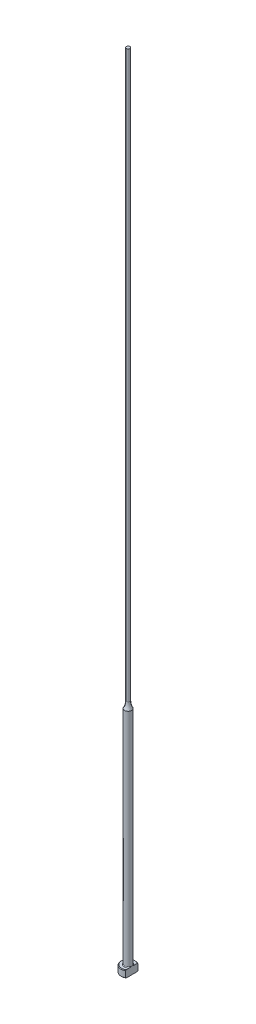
ISO-10303-21;
HEADER;
FILE_DESCRIPTION(('STEP AP214'),'2;1');
FILE_NAME('part.step','',(''),(''),'','','');
FILE_SCHEMA(('AUTOMOTIVE_DESIGN { 1 0 10303 214 1 1 1 1 }'));
ENDSEC;
DATA;
#1=APPLICATION_CONTEXT('core data for automotive mechanical design processes');
#2=APPLICATION_PROTOCOL_DEFINITION('international standard','automotive_design',2000,#1);
#3=PRODUCT_CONTEXT('',#1,'mechanical');
#4=PRODUCT('Part','Part','',(#3));
#5=PRODUCT_RELATED_PRODUCT_CATEGORY('part','',(#4));
#6=PRODUCT_DEFINITION_FORMATION('','',#4);
#7=PRODUCT_DEFINITION_CONTEXT('part definition',#1,'design');
#8=PRODUCT_DEFINITION('design','',#6,#7);
#9=PRODUCT_DEFINITION_SHAPE('','',#8);
#10=(LENGTH_UNIT() NAMED_UNIT(*) SI_UNIT(.MILLI.,.METRE.));
#11=(NAMED_UNIT(*) PLANE_ANGLE_UNIT() SI_UNIT($,.RADIAN.));
#12=(NAMED_UNIT(*) SI_UNIT($,.STERADIAN.) SOLID_ANGLE_UNIT());
#13=UNCERTAINTY_MEASURE_WITH_UNIT(LENGTH_MEASURE(1.E-05),#10,'distance_accuracy_value','');
#14=(GEOMETRIC_REPRESENTATION_CONTEXT(3) GLOBAL_UNCERTAINTY_ASSIGNED_CONTEXT((#13)) GLOBAL_UNIT_ASSIGNED_CONTEXT((#10,
#11,#12)) REPRESENTATION_CONTEXT('',''));
#15=CARTESIAN_POINT('',(0.,0.,0.));
#16=DIRECTION('',(0.,0.,1.));
#17=DIRECTION('',(1.,0.,0.));
#18=AXIS2_PLACEMENT_3D('',#15,#16,#17);
#19=CARTESIAN_POINT('',(-3.17499999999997,3.175,0.));
#20=DIRECTION('',(0.,1.,0.));
#21=DIRECTION('',(0.,0.,1.));
#22=AXIS2_PLACEMENT_3D('',#19,#20,#21);
#23=PLANE('',#22);
#24=CARTESIAN_POINT('',(0.,3.175,0.));
#25=DIRECTION('',(0.,1.,0.));
#26=DIRECTION('',(0.,0.,1.));
#27=AXIS2_PLACEMENT_3D('',#24,#25,#26);
#28=CIRCLE('',#27,2.92099999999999);
#29=CARTESIAN_POINT('',(1.58749999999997,3.175,-2.4519552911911));
#30=VERTEX_POINT('',#29);
#31=CARTESIAN_POINT('',(1.58749999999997,3.175,2.4519552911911));
#32=VERTEX_POINT('',#31);
#33=EDGE_CURVE('E105',#30,#32,#28,.T.);
#34=ORIENTED_EDGE('',*,*,#33,.T.);
#35=DIRECTION('',(0.,0.,1.));
#36=VECTOR('',#35,1.);
#37=CARTESIAN_POINT('',(1.58749999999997,3.17499999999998,2.74963065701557));
#38=LINE('',#37,#36);
#39=CARTESIAN_POINT('',(1.58749999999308,3.175,0.933255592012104));
#40=VERTEX_POINT('',#39);
#41=EDGE_CURVE('E126',#40,#32,#38,.T.);
#42=ORIENTED_EDGE('',*,*,#41,.F.);
#43=CARTESIAN_POINT('',(0.,3.175,0.));
#44=DIRECTION('',(0.,1.,0.));
#45=DIRECTION('',(0.,0.,1.));
#46=AXIS2_PLACEMENT_3D('',#43,#44,#45);
#47=CIRCLE('',#46,1.84149999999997);
#48=CARTESIAN_POINT('',(1.58749999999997,3.17500000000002,-0.933255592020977));
#49=VERTEX_POINT('',#48);
#50=EDGE_CURVE('E11',#40,#49,#47,.F.);
#51=ORIENTED_EDGE('',*,*,#50,.T.);
#52=EDGE_CURVE('E52',#30,#49,#38,.T.);
#53=ORIENTED_EDGE('',*,*,#52,.F.);
#54=EDGE_LOOP('',(#34,#42,#51,#53));
#55=FACE_BOUND('',#54,.T.);
#56=ADVANCED_FACE('F32',(#55),#23,.T.);
#57=CARTESIAN_POINT('',(0.,259.958771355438,0.));
#58=DIRECTION('',(0.,1.,0.));
#59=DIRECTION('',(0.,0.,1.));
#60=AXIS2_PLACEMENT_3D('',#57,#58,#59);
#61=CYLINDRICAL_SURFACE('',#60,3.17499999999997);
#62=CARTESIAN_POINT('',(0.,2.92100000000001,0.));
#63=DIRECTION('',(0.,1.,0.));
#64=DIRECTION('',(0.,0.,1.));
#65=AXIS2_PLACEMENT_3D('',#62,#63,#64);
#66=CIRCLE('',#65,3.17499999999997);
#67=CARTESIAN_POINT('',(1.58749999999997,2.92100000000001,2.74963065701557));
#68=VERTEX_POINT('',#67);
#69=CARTESIAN_POINT('',(1.58749999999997,2.92100000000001,-2.74963065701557));
#70=VERTEX_POINT('',#69);
#71=EDGE_CURVE('E98',#68,#70,#66,.F.);
#72=ORIENTED_EDGE('',*,*,#71,.T.);
#73=DIRECTION('',(0.,-1.,0.));
#74=VECTOR('',#73,1.);
#75=CARTESIAN_POINT('',(1.58749999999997,355.601,-2.74963065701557));
#76=LINE('',#75,#74);
#77=CARTESIAN_POINT('',(1.58749999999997,0.253999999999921,-2.74963065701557));
#78=VERTEX_POINT('',#77);
#79=EDGE_CURVE('E141',#70,#78,#76,.T.);
#80=ORIENTED_EDGE('',*,*,#79,.T.);
#81=CARTESIAN_POINT('',(0.,0.253999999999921,0.));
#82=DIRECTION('',(0.,-1.,0.));
#83=DIRECTION('',(0.,0.,-1.));
#84=AXIS2_PLACEMENT_3D('',#81,#82,#83);
#85=CIRCLE('',#84,3.17499999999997);
#86=CARTESIAN_POINT('',(1.58749999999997,0.253999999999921,2.74963065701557));
#87=VERTEX_POINT('',#86);
#88=EDGE_CURVE('E95',#78,#87,#85,.F.);
#89=ORIENTED_EDGE('',*,*,#88,.T.);
#90=DIRECTION('',(0.,-1.,0.));
#91=VECTOR('',#90,1.);
#92=CARTESIAN_POINT('',(1.58749999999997,355.601,2.74963065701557));
#93=LINE('',#92,#91);
#94=EDGE_CURVE('E88',#68,#87,#93,.T.);
#95=ORIENTED_EDGE('',*,*,#94,.F.);
#96=EDGE_LOOP('',(#72,#80,#89,#95));
#97=FACE_BOUND('',#96,.T.);
#98=ADVANCED_FACE('F191',(#97),#61,.T.);
#99=CARTESIAN_POINT('',(0.,0.,0.));
#100=DIRECTION('',(0.,-1.,0.));
#101=DIRECTION('',(0.,0.,-1.));
#102=AXIS2_PLACEMENT_3D('',#99,#100,#101);
#103=PLANE('',#102);
#104=CARTESIAN_POINT('',(0.,0.,0.));
#105=DIRECTION('',(0.,-1.,0.));
#106=DIRECTION('',(0.,0.,-1.));
#107=AXIS2_PLACEMENT_3D('',#104,#105,#106);
#108=CIRCLE('',#107,2.92100000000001);
#109=CARTESIAN_POINT('',(1.58749999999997,0.,2.45195529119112));
#110=VERTEX_POINT('',#109);
#111=CARTESIAN_POINT('',(1.58749999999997,0.,-2.45195529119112));
#112=VERTEX_POINT('',#111);
#113=EDGE_CURVE('E93',#110,#112,#108,.T.);
#114=ORIENTED_EDGE('',*,*,#113,.T.);
#115=DIRECTION('',(0.,0.,1.));
#116=VECTOR('',#115,1.);
#117=CARTESIAN_POINT('',(1.58749999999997,0.,2.74963065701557));
#118=LINE('',#117,#116);
#119=EDGE_CURVE('E78',#112,#110,#118,.T.);
#120=ORIENTED_EDGE('',*,*,#119,.T.);
#121=EDGE_LOOP('',(#114,#120));
#122=FACE_BOUND('',#121,.T.);
#123=ADVANCED_FACE('F97',(#122),#103,.T.);
#124=CARTESIAN_POINT('',(0.,3.17499999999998,0.));
#125=DIRECTION('',(0.,-1.,0.));
#126=DIRECTION('',(0.,0.,-1.));
#127=AXIS2_PLACEMENT_3D('',#124,#125,#126);
#128=CONICAL_SURFACE('',#127,2.92100000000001,0.785398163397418);
#129=ORIENTED_EDGE('',*,*,#71,.F.);
#130=CARTESIAN_POINT('',(1.58749999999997,-0.161620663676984,-6.0529050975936));
#131=CARTESIAN_POINT('',(1.58749999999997,-0.0288893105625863,-5.91567682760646));
#132=CARTESIAN_POINT('',(1.58749999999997,0.103699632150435,-5.77831035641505));
#133=CARTESIAN_POINT('',(1.58749999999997,0.368508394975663,-5.50321874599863));
#134=CARTESIAN_POINT('',(1.58749999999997,0.5007282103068,-5.3654936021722));
#135=CARTESIAN_POINT('',(1.58749999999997,0.764778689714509,-5.08953516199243));
#136=CARTESIAN_POINT('',(1.58749999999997,0.896609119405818,-4.95130164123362));
#137=CARTESIAN_POINT('',(1.58749999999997,1.15968706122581,-4.67428233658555));
#138=CARTESIAN_POINT('',(1.58749999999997,1.29093457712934,-4.5354965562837));
#139=CARTESIAN_POINT('',(1.58749999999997,1.55007705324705,-4.25997724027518));
#140=CARTESIAN_POINT('',(1.58749999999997,1.67798684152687,-4.12325766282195));
#141=CARTESIAN_POINT('',(1.58749999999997,1.9328486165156,-3.84892898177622));
#142=CARTESIAN_POINT('',(1.58749999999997,2.05980060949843,-3.71131988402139));
#143=CARTESIAN_POINT('',(1.58749999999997,2.31237508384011,-3.43493978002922));
#144=CARTESIAN_POINT('',(1.58749999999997,2.43799784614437,-3.29616903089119));
#145=CARTESIAN_POINT('',(1.58749999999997,2.68741369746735,-3.01699558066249));
#146=CARTESIAN_POINT('',(1.58749999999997,2.81120686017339,-2.8765929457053));
#147=CARTESIAN_POINT('',(1.58749999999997,3.00875865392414,-2.64816703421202));
#148=CARTESIAN_POINT('',(1.58749999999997,3.08336151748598,-2.56087478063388));
#149=CARTESIAN_POINT('',(1.58749999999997,3.23123871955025,-2.385154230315));
#150=CARTESIAN_POINT('',(1.58749999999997,3.30451292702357,-2.29672582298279));
#151=CARTESIAN_POINT('',(1.58749999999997,3.45004422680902,-2.11747400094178));
#152=CARTESIAN_POINT('',(1.58749999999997,3.52228237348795,-2.02663514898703));
#153=CARTESIAN_POINT('',(1.58749999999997,3.66423097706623,-1.84302524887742));
#154=CARTESIAN_POINT('',(1.58749999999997,3.73394203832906,-1.75025467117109));
#155=CARTESIAN_POINT('',(1.58749999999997,3.87080633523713,-1.56067475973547));
#156=CARTESIAN_POINT('',(1.58749999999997,3.93790459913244,-1.46382547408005));
#157=CARTESIAN_POINT('',(1.58749999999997,4.06669147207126,-1.26632594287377));
#158=CARTESIAN_POINT('',(1.58749999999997,4.12837264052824,-1.16567073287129));
#159=CARTESIAN_POINT('',(1.58749999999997,4.21402252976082,-1.01165766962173));
#160=CARTESIAN_POINT('',(1.58749999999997,4.2412792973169,-0.960142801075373));
#161=CARTESIAN_POINT('',(1.58749999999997,4.29309798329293,-0.85578092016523));
#162=CARTESIAN_POINT('',(1.58749999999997,4.3176594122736,-0.802933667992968));
#163=CARTESIAN_POINT('',(1.58749999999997,4.38614656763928,-0.642461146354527));
#164=CARTESIAN_POINT('',(1.58749999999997,4.42510149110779,-0.532518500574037));
#165=CARTESIAN_POINT('',(1.58749999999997,4.46726244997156,-0.367680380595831));
#166=CARTESIAN_POINT('',(1.58749999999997,4.47844427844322,-0.314802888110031));
#167=CARTESIAN_POINT('',(1.58749999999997,4.49576654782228,-0.208209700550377));
#168=CARTESIAN_POINT('',(1.58749999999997,4.50190743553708,-0.154494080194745));
#169=CARTESIAN_POINT('',(1.58749999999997,4.50871296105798,-0.0468792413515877));
#170=CARTESIAN_POINT('',(1.58749999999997,4.50939451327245,0.00701889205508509));
#171=CARTESIAN_POINT('',(1.58749999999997,4.5052767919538,0.114606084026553));
#172=CARTESIAN_POINT('',(1.58749999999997,4.5004770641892,0.16829512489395));
#173=CARTESIAN_POINT('',(1.58749999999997,4.48579689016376,0.274485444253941));
#174=CARTESIAN_POINT('',(1.58749999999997,4.47596081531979,0.326992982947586));
#175=CARTESIAN_POINT('',(1.58749999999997,4.4518180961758,0.430974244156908));
#176=CARTESIAN_POINT('',(1.58749999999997,4.43750969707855,0.482447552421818));
#177=CARTESIAN_POINT('',(1.58749999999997,4.40502489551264,0.58446088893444));
#178=CARTESIAN_POINT('',(1.58749999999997,4.38682724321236,0.634994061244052));
#179=CARTESIAN_POINT('',(1.58749999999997,4.34729308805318,0.734789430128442));
#180=CARTESIAN_POINT('',(1.58749999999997,4.32595722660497,0.784051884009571));
#181=CARTESIAN_POINT('',(1.58749999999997,4.25791922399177,0.93054934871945));
#182=CARTESIAN_POINT('',(1.58749999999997,4.20736047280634,1.02598802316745));
#183=CARTESIAN_POINT('',(1.58749999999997,4.09955451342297,1.21304313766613));
#184=CARTESIAN_POINT('',(1.58749999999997,4.04229912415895,1.30465471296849));
#185=CARTESIAN_POINT('',(1.58749999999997,3.92308746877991,1.48526211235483));
#186=CARTESIAN_POINT('',(1.58749999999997,3.86111349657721,1.57424615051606));
#187=CARTESIAN_POINT('',(1.58749999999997,3.73408621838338,1.74990003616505));
#188=CARTESIAN_POINT('',(1.58749999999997,3.66903444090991,1.83657099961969));
#189=CARTESIAN_POINT('',(1.58749999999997,3.53583371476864,2.009317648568));
#190=CARTESIAN_POINT('',(1.58749999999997,3.46765527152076,2.09537048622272));
#191=CARTESIAN_POINT('',(1.58749999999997,3.32960643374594,2.26611736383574));
#192=CARTESIAN_POINT('',(1.58749999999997,3.25973586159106,2.35081125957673));
#193=CARTESIAN_POINT('',(1.58749999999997,3.04858139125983,2.60290121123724));
#194=CARTESIAN_POINT('',(1.58749999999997,2.90542388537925,2.7687253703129));
#195=CARTESIAN_POINT('',(1.58749999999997,2.64069522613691,3.06970913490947));
#196=CARTESIAN_POINT('',(1.58749999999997,2.5195945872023,3.20528660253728));
#197=CARTESIAN_POINT('',(1.58749999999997,2.27590400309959,3.47510321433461));
#198=CARTESIAN_POINT('',(1.58749999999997,2.1533140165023,3.60934232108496));
#199=CARTESIAN_POINT('',(1.58749999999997,1.9069423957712,3.87695374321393));
#200=CARTESIAN_POINT('',(1.58749999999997,1.78315974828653,4.01032512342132));
#201=CARTESIAN_POINT('',(1.58749999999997,1.53478104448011,4.2763088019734));
#202=CARTESIAN_POINT('',(1.58749999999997,1.41018498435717,4.40892109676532));
#203=CARTESIAN_POINT('',(1.58749999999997,1.04574684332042,4.79499418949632));
#204=CARTESIAN_POINT('',(1.58749999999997,0.805076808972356,5.04767313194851));
#205=CARTESIAN_POINT('',(1.58749999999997,0.44312150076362,5.42550911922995));
#206=CARTESIAN_POINT('',(1.58749999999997,0.322378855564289,5.55118772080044));
#207=CARTESIAN_POINT('',(1.58749999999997,0.0805914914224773,5.8022520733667));
#208=CARTESIAN_POINT('',(1.58749999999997,-0.0404532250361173,5.92763782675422));
#209=CARTESIAN_POINT('',(1.58749999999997,-0.161620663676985,6.0529050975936));
#210=B_SPLINE_CURVE_WITH_KNOTS('',3,(#130,#131,#132,#133,#134,#135,#136,#137,#138,#139,#140,
#141,#142,#143,#144,#145,#146,#147,#148,#149,#150,#151,#152,#153,#154,#155,#156,#157,#158,#159,
#160,#161,#162,#163,#164,#165,#166,#167,#168,#169,#170,#171,#172,#173,#174,#175,#176,#177,#178,
#179,#180,#181,#182,#183,#184,#185,#186,#187,#188,#189,#190,#191,#192,#193,#194,#195,#196,#197,
#198,#199,#200,#201,#202,#203,#204,#205,#206,#207,#208,#209),.UNSPECIFIED.,.F.,.F.,(4,2,2,2,2,2,
2,2,2,2,2,2,2,2,2,2,2,2,2,2,2,2,2,2,2,2,2,2,2,2,2,2,2,2,2,2,2,2,2,4),(0.,0.572750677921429,
1.14550874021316,1.71856057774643,2.29160869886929,2.85328006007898,3.41494773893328,
3.97649423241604,4.53801804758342,4.88249307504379,5.2270018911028,5.57515326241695,
5.92322081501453,6.27657800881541,6.63041319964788,6.80518126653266,6.97998101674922,
7.32824262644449,7.49018491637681,7.65211285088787,7.81353889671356,7.97497832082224,
8.13501929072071,8.29512313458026,8.45612518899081,8.61709438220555,8.94062993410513,
9.26456495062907,9.58978187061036,9.91483894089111,10.2441741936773,10.5735441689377,
11.2306812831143,11.7760337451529,12.3214014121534,12.8672825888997,13.4131663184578,
14.4600164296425,14.9828595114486,15.505698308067),.UNSPECIFIED.);
#211=EDGE_CURVE('E118',#32,#68,#210,.T.);
#212=ORIENTED_EDGE('',*,*,#211,.F.);
#213=ORIENTED_EDGE('',*,*,#33,.F.);
#214=EDGE_CURVE('E117',#70,#30,#210,.T.);
#215=ORIENTED_EDGE('',*,*,#214,.F.);
#216=EDGE_LOOP('',(#129,#212,#213,#215));
#217=FACE_BOUND('',#216,.T.);
#218=ADVANCED_FACE('F162',(#217),#128,.T.);
#219=CARTESIAN_POINT('',(0.,0.253999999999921,0.));
#220=DIRECTION('',(0.,1.,0.));
#221=DIRECTION('',(0.,0.,1.));
#222=AXIS2_PLACEMENT_3D('',#219,#220,#221);
#223=CONICAL_SURFACE('',#222,3.17499999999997,0.785398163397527);
#224=ORIENTED_EDGE('',*,*,#88,.F.);
#225=CARTESIAN_POINT('',(1.58749999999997,3.33662066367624,6.0529050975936));
#226=CARTESIAN_POINT('',(1.58749999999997,3.20388931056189,5.91567682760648));
#227=CARTESIAN_POINT('',(1.58749999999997,3.07130036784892,5.7783103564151));
#228=CARTESIAN_POINT('',(1.58749999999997,2.80649160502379,5.50321874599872));
#229=CARTESIAN_POINT('',(1.58749999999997,2.6742717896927,5.36549360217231));
#230=CARTESIAN_POINT('',(1.58749999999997,2.41022131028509,5.08953516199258));
#231=CARTESIAN_POINT('',(1.58749999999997,2.27839088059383,4.95130164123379));
#232=CARTESIAN_POINT('',(1.58749999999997,2.01531293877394,4.67428233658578));
#233=CARTESIAN_POINT('',(1.58749999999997,1.88406542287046,4.53549655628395));
#234=CARTESIAN_POINT('',(1.58749999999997,1.62492294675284,4.25997724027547));
#235=CARTESIAN_POINT('',(1.58749999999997,1.49701315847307,4.12325766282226));
#236=CARTESIAN_POINT('',(1.58749999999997,1.24215138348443,3.84892898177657));
#237=CARTESIAN_POINT('',(1.58749999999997,1.11519939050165,3.71131988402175));
#238=CARTESIAN_POINT('',(1.58749999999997,0.862624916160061,3.43493978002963));
#239=CARTESIAN_POINT('',(1.58749999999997,0.737002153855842,3.29616903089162));
#240=CARTESIAN_POINT('',(1.58749999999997,0.487586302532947,3.01699558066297));
#241=CARTESIAN_POINT('',(1.58749999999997,0.363793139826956,2.8765929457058));
#242=CARTESIAN_POINT('',(1.58749999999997,0.166241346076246,2.64816703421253));
#243=CARTESIAN_POINT('',(1.58749999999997,0.0916384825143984,2.56087478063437));
#244=CARTESIAN_POINT('',(1.58749999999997,-0.0562387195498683,2.38515423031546));
#245=CARTESIAN_POINT('',(1.58749999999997,-0.129512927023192,2.29672582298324));
#246=CARTESIAN_POINT('',(1.58749999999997,-0.275044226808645,2.1174740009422));
#247=CARTESIAN_POINT('',(1.58749999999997,-0.347282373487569,2.02663514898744));
#248=CARTESIAN_POINT('',(1.58749999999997,-0.489230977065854,1.8430252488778));
#249=CARTESIAN_POINT('',(1.58749999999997,-0.558942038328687,1.75025467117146));
#250=CARTESIAN_POINT('',(1.58749999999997,-0.695806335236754,1.5606747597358));
#251=CARTESIAN_POINT('',(1.58749999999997,-0.762904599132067,1.46382547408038));
#252=CARTESIAN_POINT('',(1.58749999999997,-0.89169147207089,1.26632594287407));
#253=CARTESIAN_POINT('',(1.58749999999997,-0.953372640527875,1.16567073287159));
#254=CARTESIAN_POINT('',(1.58749999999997,-1.03902252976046,1.01165766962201));
#255=CARTESIAN_POINT('',(1.58749999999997,-1.06627929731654,0.960142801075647));
#256=CARTESIAN_POINT('',(1.58749999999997,-1.11809798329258,0.855780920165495));
#257=CARTESIAN_POINT('',(1.58749999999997,-1.14265941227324,0.802933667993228));
#258=CARTESIAN_POINT('',(1.58749999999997,-1.21114656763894,0.642461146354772));
#259=CARTESIAN_POINT('',(1.58749999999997,-1.25010149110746,0.532518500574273));
#260=CARTESIAN_POINT('',(1.58749999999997,-1.29226244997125,0.367680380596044));
#261=CARTESIAN_POINT('',(1.58749999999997,-1.30344427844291,0.314802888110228));
#262=CARTESIAN_POINT('',(1.58749999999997,-1.32076654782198,0.208209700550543));
#263=CARTESIAN_POINT('',(1.58749999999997,-1.32690743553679,0.154494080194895));
#264=CARTESIAN_POINT('',(1.58749999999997,-1.3337129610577,0.0468792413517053));
#265=CARTESIAN_POINT('',(1.58749999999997,-1.33439451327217,-0.00701889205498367));
#266=CARTESIAN_POINT('',(1.58749999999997,-1.33027679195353,-0.114606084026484));
#267=CARTESIAN_POINT('',(1.58749999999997,-1.32547706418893,-0.168295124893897));
#268=CARTESIAN_POINT('',(1.58749999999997,-1.31079689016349,-0.274485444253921));
#269=CARTESIAN_POINT('',(1.58749999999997,-1.30096081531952,-0.326992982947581));
#270=CARTESIAN_POINT('',(1.58749999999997,-1.27681809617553,-0.430974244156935));
#271=CARTESIAN_POINT('',(1.58749999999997,-1.26250969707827,-0.48244755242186));
#272=CARTESIAN_POINT('',(1.58749999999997,-1.23002489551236,-0.584460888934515));
#273=CARTESIAN_POINT('',(1.58749999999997,-1.21182724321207,-0.634994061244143));
#274=CARTESIAN_POINT('',(1.58749999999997,-1.17229308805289,-0.734789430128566));
#275=CARTESIAN_POINT('',(1.58749999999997,-1.15095722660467,-0.784051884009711));
#276=CARTESIAN_POINT('',(1.58749999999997,-1.08291922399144,-0.930549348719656));
#277=CARTESIAN_POINT('',(1.58749999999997,-1.03236047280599,-1.0259880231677));
#278=CARTESIAN_POINT('',(1.58749999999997,-0.924554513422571,-1.21304313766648));
#279=CARTESIAN_POINT('',(1.58749999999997,-0.867299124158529,-1.30465471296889));
#280=CARTESIAN_POINT('',(1.58749999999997,-0.748087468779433,-1.48526211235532));
#281=CARTESIAN_POINT('',(1.58749999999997,-0.686113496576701,-1.5742461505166));
#282=CARTESIAN_POINT('',(1.58749999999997,-0.559086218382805,-1.74990003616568));
#283=CARTESIAN_POINT('',(1.58749999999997,-0.494034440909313,-1.83657099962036));
#284=CARTESIAN_POINT('',(1.58749999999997,-0.360833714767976,-2.00931764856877));
#285=CARTESIAN_POINT('',(1.58749999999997,-0.292655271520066,-2.09537048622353));
#286=CARTESIAN_POINT('',(1.58749999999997,-0.154606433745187,-2.26611736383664));
#287=CARTESIAN_POINT('',(1.58749999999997,-0.0847358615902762,-2.35081125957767));
#288=CARTESIAN_POINT('',(1.58749999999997,0.126418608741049,-2.60290121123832));
#289=CARTESIAN_POINT('',(1.58749999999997,0.269576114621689,-2.76872537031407));
#290=CARTESIAN_POINT('',(1.58749999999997,0.534304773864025,-3.06970913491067));
#291=CARTESIAN_POINT('',(1.58749999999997,0.655405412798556,-3.20528660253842));
#292=CARTESIAN_POINT('',(1.58749999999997,0.899095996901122,-3.47510321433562));
#293=CARTESIAN_POINT('',(1.58749999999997,1.02168598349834,-3.60934232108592));
#294=CARTESIAN_POINT('',(1.58749999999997,1.26805760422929,-3.87695374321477));
#295=CARTESIAN_POINT('',(1.58749999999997,1.39184025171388,-4.0103251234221));
#296=CARTESIAN_POINT('',(1.58749999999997,1.64021895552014,-4.27630880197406));
#297=CARTESIAN_POINT('',(1.58749999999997,1.76481501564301,-4.40892109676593));
#298=CARTESIAN_POINT('',(1.58749999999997,2.12925315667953,-4.79499418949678));
#299=CARTESIAN_POINT('',(1.58749999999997,2.36992319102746,-5.04767313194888));
#300=CARTESIAN_POINT('',(1.58749999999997,2.73187849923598,-5.42550911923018));
#301=CARTESIAN_POINT('',(1.58749999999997,2.85262114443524,-5.55118772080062));
#302=CARTESIAN_POINT('',(1.58749999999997,3.09440850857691,-5.80225207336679));
#303=CARTESIAN_POINT('',(1.58749999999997,3.21545322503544,-5.92763782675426));
#304=CARTESIAN_POINT('',(1.58749999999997,3.33662066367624,-6.0529050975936));
#305=B_SPLINE_CURVE_WITH_KNOTS('',3,(#225,#226,#227,#228,#229,#230,#231,#232,#233,#234,#235,
#236,#237,#238,#239,#240,#241,#242,#243,#244,#245,#246,#247,#248,#249,#250,#251,#252,#253,#254,
#255,#256,#257,#258,#259,#260,#261,#262,#263,#264,#265,#266,#267,#268,#269,#270,#271,#272,#273,
#274,#275,#276,#277,#278,#279,#280,#281,#282,#283,#284,#285,#286,#287,#288,#289,#290,#291,#292,
#293,#294,#295,#296,#297,#298,#299,#300,#301,#302,#303,#304),.UNSPECIFIED.,.F.,.F.,(4,2,2,2,2,2,
2,2,2,2,2,2,2,2,2,2,2,2,2,2,2,2,2,2,2,2,2,2,2,2,2,2,2,2,2,2,2,2,2,4),(0.,0.572750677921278,
1.14550874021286,1.71856057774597,2.29160869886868,2.85328006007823,3.4149477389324,
3.97649423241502,4.53801804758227,4.88249307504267,5.22700189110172,5.5751532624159,
5.92322081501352,6.27657800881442,6.63041319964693,6.80518126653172,6.9799810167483,
7.3282426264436,7.49018491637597,7.65211285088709,7.81353889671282,7.97497832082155,
8.13501929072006,8.29512313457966,8.45612518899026,8.61709438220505,8.9406299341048,
9.2645649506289,9.58978187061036,9.91483894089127,10.2441741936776,10.5735441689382,
11.2306812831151,11.7760337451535,12.3214014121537,12.8672825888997,13.4131663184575,
14.4600164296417,14.9828595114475,15.5056983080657),.UNSPECIFIED.);
#306=EDGE_CURVE('E81',#112,#78,#305,.T.);
#307=ORIENTED_EDGE('',*,*,#306,.F.);
#308=ORIENTED_EDGE('',*,*,#113,.F.);
#309=EDGE_CURVE('E84',#87,#110,#305,.T.);
#310=ORIENTED_EDGE('',*,*,#309,.F.);
#311=EDGE_LOOP('',(#224,#307,#308,#310));
#312=FACE_BOUND('',#311,.T.);
#313=ADVANCED_FACE('F92',(#312),#223,.T.);
#314=CARTESIAN_POINT('',(0.,3.42900000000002,0.));
#315=DIRECTION('',(0.,1.,0.));
#316=DIRECTION('',(0.,0.,1.));
#317=AXIS2_PLACEMENT_3D('',#314,#315,#316);
#318=TOROIDAL_SURFACE('',#317,1.84149999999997,0.254);
#319=CARTESIAN_POINT('',(1.58749999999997,3.42900000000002,0.));
#320=CARTESIAN_POINT('',(1.58749999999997,3.42899942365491,-1.9220514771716E-10));
#321=CARTESIAN_POINT('',(1.58749999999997,3.42899884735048,-1.2261161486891E-07));
#322=CARTESIAN_POINT('',(1.58749999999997,3.42899773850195,-5.09676365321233E-07));
#323=CARTESIAN_POINT('',(1.58749999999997,3.42899720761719,-7.78176328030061E-07));
#324=CARTESIAN_POINT('',(1.58749999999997,3.42899614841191,-1.42307272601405E-06));
#325=CARTESIAN_POINT('',(1.58749999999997,3.42899562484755,-1.80713867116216E-06));
#326=CARTESIAN_POINT('',(1.58749999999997,3.42899463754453,-2.63494846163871E-06));
#327=CARTESIAN_POINT('',(1.58749999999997,3.42899417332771,-3.07814756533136E-06));
#328=CARTESIAN_POINT('',(1.58749999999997,3.42899261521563,-4.66897357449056E-06));
#329=CARTESIAN_POINT('',(1.58749999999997,3.42899159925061,-5.89404908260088E-06));
#330=CARTESIAN_POINT('',(1.58749999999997,3.42898979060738,-8.42427511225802E-06));
#331=CARTESIAN_POINT('',(1.58749999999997,3.42898899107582,-9.7248057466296E-06));
#332=CARTESIAN_POINT('',(1.58749999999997,3.42898598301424,-1.48060601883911E-05));
#333=CARTESIAN_POINT('',(1.58749999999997,3.42898393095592,-1.86838281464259E-05));
#334=CARTESIAN_POINT('',(1.58749999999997,3.42898057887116,-2.63261117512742E-05));
#335=CARTESIAN_POINT('',(1.58749999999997,3.42897922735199,-3.00687417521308E-05));
#336=CARTESIAN_POINT('',(1.58749999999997,3.42897347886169,-4.60276298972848E-05));
#337=CARTESIAN_POINT('',(1.58749999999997,3.42896911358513,-5.8247019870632E-05));
#338=CARTESIAN_POINT('',(1.58749999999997,3.42896211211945,-8.11070097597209E-05));
#339=CARTESIAN_POINT('',(1.58749999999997,3.42895931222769,-9.16953114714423E-05));
#340=CARTESIAN_POINT('',(1.58749999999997,3.42893712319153,-0.000168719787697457));
#341=CARTESIAN_POINT('',(1.58749999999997,3.42890881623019,-0.000232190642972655));
#342=CARTESIAN_POINT('',(1.58749999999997,3.42880276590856,-0.000479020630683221));
#343=CARTESIAN_POINT('',(1.58749999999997,3.42873165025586,-0.00066443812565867));
#344=CARTESIAN_POINT('',(1.58749999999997,3.42845137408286,-0.0013844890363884));
#345=CARTESIAN_POINT('',(1.58749999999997,3.42823526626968,-0.00191701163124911));
#346=CARTESIAN_POINT('',(1.58749999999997,3.42735449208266,-0.00409774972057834));
#347=CARTESIAN_POINT('',(1.58749999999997,3.42669768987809,-0.00574830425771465));
#348=CARTESIAN_POINT('',(1.58749999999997,3.4174405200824,-0.0289985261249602));
#349=CARTESIAN_POINT('',(1.58749999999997,3.40878325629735,-0.0505816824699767));
#350=CARTESIAN_POINT('',(1.58749999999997,3.39189297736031,-0.0929947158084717));
#351=CARTESIAN_POINT('',(1.58749999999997,3.38365605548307,-0.11382315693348));
#352=CARTESIAN_POINT('',(1.58749999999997,3.36635393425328,-0.157956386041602));
#353=CARTESIAN_POINT('',(1.58749999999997,3.35730391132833,-0.181267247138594));
#354=CARTESIAN_POINT('',(1.58749999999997,3.33936775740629,-0.228222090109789));
#355=CARTESIAN_POINT('',(1.58749999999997,3.33048420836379,-0.25186705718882));
#356=CARTESIAN_POINT('',(1.58749999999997,3.30894496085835,-0.310512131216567));
#357=CARTESIAN_POINT('',(1.58749999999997,3.29649449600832,-0.345588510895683));
#358=CARTESIAN_POINT('',(1.58749999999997,3.27296975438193,-0.415278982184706));
#359=CARTESIAN_POINT('',(1.58749999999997,3.26186987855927,-0.449884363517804));
#360=CARTESIAN_POINT('',(1.58749999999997,3.2395832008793,-0.524471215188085));
#361=CARTESIAN_POINT('',(1.58749999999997,3.22860862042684,-0.564517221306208));
#362=CARTESIAN_POINT('',(1.58749999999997,3.20902534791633,-0.645529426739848));
#363=CARTESIAN_POINT('',(1.58749999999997,3.20043582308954,-0.686500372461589));
#364=CARTESIAN_POINT('',(1.58749999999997,3.18611712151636,-0.771546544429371));
#365=CARTESIAN_POINT('',(1.58749999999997,3.18059550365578,-0.815658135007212));
#366=CARTESIAN_POINT('',(1.58749999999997,3.17455396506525,-0.904117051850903));
#367=CARTESIAN_POINT('',(1.58749999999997,3.17401361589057,-0.948462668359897));
#368=CARTESIAN_POINT('',(1.58749999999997,3.17898948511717,-1.02531896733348));
#369=CARTESIAN_POINT('',(1.58749999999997,3.1829739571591,-1.05792141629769));
#370=CARTESIAN_POINT('',(1.58749999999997,3.19569167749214,-1.12184393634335));
#371=CARTESIAN_POINT('',(1.58749999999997,3.20436049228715,-1.1531753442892));
#372=CARTESIAN_POINT('',(1.58749999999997,3.22236152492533,-1.19946468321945));
#373=CARTESIAN_POINT('',(1.58749999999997,3.2295150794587,-1.21526783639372));
#374=CARTESIAN_POINT('',(1.58749999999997,3.24587062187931,-1.24583726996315));
#375=CARTESIAN_POINT('',(1.58749999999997,3.25507530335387,-1.26060215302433));
#376=CARTESIAN_POINT('',(1.58749999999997,3.27378481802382,-1.28575815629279));
#377=CARTESIAN_POINT('',(1.58749999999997,3.28289001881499,-1.29644383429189));
#378=CARTESIAN_POINT('',(1.58749999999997,3.30268460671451,-1.31623154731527));
#379=CARTESIAN_POINT('',(1.58749999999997,3.31337067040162,-1.32533681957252));
#380=CARTESIAN_POINT('',(1.58749999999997,3.33349977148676,-1.33941140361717));
#381=CARTESIAN_POINT('',(1.58749999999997,3.34261446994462,-1.34484814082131));
#382=CARTESIAN_POINT('',(1.58749999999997,3.36161455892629,-1.35416329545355));
#383=CARTESIAN_POINT('',(1.58749999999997,3.37149946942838,-1.35804267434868));
#384=CARTESIAN_POINT('',(1.58749999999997,3.39188678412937,-1.36398436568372));
#385=CARTESIAN_POINT('',(1.58749999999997,3.40239309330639,-1.36603350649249));
#386=CARTESIAN_POINT('',(1.58749999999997,3.42360372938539,-1.3680840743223));
#387=CARTESIAN_POINT('',(1.58749999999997,3.43430795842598,-1.36808648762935));
#388=CARTESIAN_POINT('',(1.58749999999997,3.45433283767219,-1.36616208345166));
#389=CARTESIAN_POINT('',(1.58749999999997,3.46367506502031,-1.36444960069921));
#390=CARTESIAN_POINT('',(1.58749999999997,3.48195519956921,-1.35953338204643));
#391=CARTESIAN_POINT('',(1.58749999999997,3.49089304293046,-1.3563294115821));
#392=CARTESIAN_POINT('',(1.58749999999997,3.50850302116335,-1.34848006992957));
#393=CARTESIAN_POINT('',(1.58749999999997,3.5171531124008,-1.34378578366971));
#394=CARTESIAN_POINT('',(1.58749999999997,3.53371257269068,-1.33324445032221));
#395=CARTESIAN_POINT('',(1.58749999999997,3.54162163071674,-1.32739692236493));
#396=CARTESIAN_POINT('',(1.58749999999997,3.56107121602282,-1.31107304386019));
#397=CARTESIAN_POINT('',(1.58749999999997,3.57202221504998,-1.29989286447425));
#398=CARTESIAN_POINT('',(1.58749999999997,3.59202509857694,-1.27593566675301));
#399=CARTESIAN_POINT('',(1.58749999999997,3.60107086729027,-1.26315370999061));
#400=CARTESIAN_POINT('',(1.58749999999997,3.62186023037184,-1.22930733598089));
#401=CARTESIAN_POINT('',(1.58749999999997,3.63240584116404,-1.20751096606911));
#402=CARTESIAN_POINT('',(1.58749999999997,3.65004643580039,-1.16266144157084));
#403=CARTESIAN_POINT('',(1.58749999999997,3.65714435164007,-1.13960937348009));
#404=CARTESIAN_POINT('',(1.58749999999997,3.67265428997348,-1.07603916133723));
#405=CARTESIAN_POINT('',(1.58749999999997,3.67834921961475,-1.03486686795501));
#406=CARTESIAN_POINT('',(1.58749999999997,3.68382880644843,-0.951558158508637));
#407=CARTESIAN_POINT('',(1.58749999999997,3.68350976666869,-0.909417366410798));
#408=CARTESIAN_POINT('',(1.58749999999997,3.67745397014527,-0.811383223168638));
#409=CARTESIAN_POINT('',(1.58749999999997,3.66993873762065,-0.755610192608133));
#410=CARTESIAN_POINT('',(1.58749999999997,3.64933373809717,-0.644937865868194));
#411=CARTESIAN_POINT('',(1.58749999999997,3.63621897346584,-0.59004364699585));
#412=CARTESIAN_POINT('',(1.58749999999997,3.60740922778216,-0.485757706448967));
#413=CARTESIAN_POINT('',(1.58749999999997,3.59201096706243,-0.436281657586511));
#414=CARTESIAN_POINT('',(1.58749999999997,3.55922497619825,-0.338551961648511));
#415=CARTESIAN_POINT('',(1.58749999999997,3.5418584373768,-0.290291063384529));
#416=CARTESIAN_POINT('',(1.58749999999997,3.51760237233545,-0.225557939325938));
#417=CARTESIAN_POINT('',(1.58749999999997,3.51126413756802,-0.208874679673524));
#418=CARTESIAN_POINT('',(1.58749999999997,3.49830042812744,-0.17512392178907));
#419=CARTESIAN_POINT('',(1.58749999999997,3.49167176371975,-0.158057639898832));
#420=CARTESIAN_POINT('',(1.58749999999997,3.47585523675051,-0.117638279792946));
#421=CARTESIAN_POINT('',(1.58749999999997,3.46662970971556,-0.0943002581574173));
#422=CARTESIAN_POINT('',(1.58749999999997,3.44889695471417,-0.0497824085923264));
#423=CARTESIAN_POINT('',(1.58749999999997,3.44040039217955,-0.028598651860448));
#424=CARTESIAN_POINT('',(1.58749999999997,3.43130364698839,-0.00575168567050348));
#425=CARTESIAN_POINT('',(1.58749999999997,3.43064818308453,-0.00410451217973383));
#426=CARTESIAN_POINT('',(1.58749999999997,3.42976776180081,-0.00192459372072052));
#427=CARTESIAN_POINT('',(1.58749999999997,3.42955062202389,-0.00138952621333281));
#428=CARTESIAN_POINT('',(1.58749999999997,3.42926908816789,-0.000666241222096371));
#429=CARTESIAN_POINT('',(1.58749999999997,3.42919771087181,-0.000480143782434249));
#430=CARTESIAN_POINT('',(1.58749999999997,3.42909131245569,-0.000232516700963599));
#431=CARTESIAN_POINT('',(1.58749999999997,3.42906294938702,-0.000168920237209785));
#432=CARTESIAN_POINT('',(1.58749999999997,3.42904072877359,-9.17527162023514E-05));
#433=CARTESIAN_POINT('',(1.58749999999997,3.42903792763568,-8.11550293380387E-05));
#434=CARTESIAN_POINT('',(1.58749999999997,3.42903091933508,-5.82743948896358E-05));
#435=CARTESIAN_POINT('',(1.58749999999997,3.42902654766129,-4.60440001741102E-05));
#436=CARTESIAN_POINT('',(1.58749999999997,3.42902079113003,-3.00727682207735E-05));
#437=CARTESIAN_POINT('',(1.58749999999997,3.42901943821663,-2.63286807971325E-05));
#438=CARTESIAN_POINT('',(1.58749999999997,3.42901608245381,-1.86836529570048E-05));
#439=CARTESIAN_POINT('',(1.58749999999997,3.4290140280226,-1.48046517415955E-05));
#440=CARTESIAN_POINT('',(1.58749999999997,3.42901101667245,-9.72223943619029E-06));
#441=CARTESIAN_POINT('',(1.58749999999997,3.42901021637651,-8.42159649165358E-06));
#442=CARTESIAN_POINT('',(1.58749999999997,3.42900840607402,-5.89129729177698E-06));
#443=CARTESIAN_POINT('',(1.58749999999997,3.42900738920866,-4.66626867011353E-06));
#444=CARTESIAN_POINT('',(1.58749999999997,3.42900582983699,-3.07568803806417E-06));
#445=CARTESIAN_POINT('',(1.58749999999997,3.42900536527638,-2.63259565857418E-06));
#446=CARTESIAN_POINT('',(1.58749999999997,3.4290043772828,-1.80506085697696E-06));
#447=CARTESIAN_POINT('',(1.58749999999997,3.42900385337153,-1.42116387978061E-06));
#448=CARTESIAN_POINT('',(1.58749999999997,3.42900279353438,-7.76675643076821E-07));
#449=CARTESIAN_POINT('',(1.58749999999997,3.42900226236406,-5.08406487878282E-07));
#450=CARTESIAN_POINT('',(1.58749999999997,3.42900115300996,-1.21901887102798E-07));
#451=CARTESIAN_POINT('',(1.58749999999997,3.42900057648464,1.92251677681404E-10));
#452=CARTESIAN_POINT('',(1.58749999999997,3.42900000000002,0.));
#453=B_SPLINE_CURVE_WITH_KNOTS('',3,(#319,#320,#321,#322,#323,#324,#325,#326,#327,#328,#329,
#330,#331,#332,#333,#334,#335,#336,#337,#338,#339,#340,#341,#342,#343,#344,#345,#346,#347,#348,
#349,#350,#351,#352,#353,#354,#355,#356,#357,#358,#359,#360,#361,#362,#363,#364,#365,#366,#367,
#368,#369,#370,#371,#372,#373,#374,#375,#376,#377,#378,#379,#380,#381,#382,#383,#384,#385,#386,
#387,#388,#389,#390,#391,#392,#393,#394,#395,#396,#397,#398,#399,#400,#401,#402,#403,#404,#405,
#406,#407,#408,#409,#410,#411,#412,#413,#414,#415,#416,#417,#418,#419,#420,#421,#422,#423,#424,
#425,#426,#427,#428,#429,#430,#431,#432,#433,#434,#435,#436,#437,#438,#439,#440,#441,#442,#443,
#444,#445,#446,#447,#448,#449,#450,#451,#452),.UNSPECIFIED.,.T.,.F.,(4,2,2,2,2,2,2,2,2,2,2,2,2,
2,2,2,2,2,2,2,2,2,2,2,2,2,2,2,2,2,2,2,2,2,2,2,2,2,2,2,2,2,2,2,2,2,2,2,2,2,2,2,2,2,2,2,2,2,2,2,2,
2,2,2,2,2,4),(0.,1.72815458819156E-06,3.50429255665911E-06,5.44431004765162E-06,
7.3675525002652E-06,1.2119089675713E-05,1.66953775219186E-05,2.98160400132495E-05,
4.17409564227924E-05,8.0660475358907E-05,0.000113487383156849,0.000321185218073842,
0.000917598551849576,0.00264089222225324,0.00797105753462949,0.0777276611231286,
0.144923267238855,0.219939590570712,0.295714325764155,0.407362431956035,0.516367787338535,
0.640878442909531,0.766362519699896,0.899536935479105,1.03216495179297,1.13045740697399,
1.22743103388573,1.27935899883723,1.33135556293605,1.37333248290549,1.41522237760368,
1.44693946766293,1.47863694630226,1.51056074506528,1.54246916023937,1.57083210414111,
1.59919951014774,1.62861579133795,1.65804436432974,1.70472658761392,1.75155645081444,
1.82378709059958,1.89595619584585,2.01995471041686,2.1460932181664,2.31447224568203,
2.48361094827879,2.6389891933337,2.79283011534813,2.84637031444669,2.9012946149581,
2.97658236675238,3.04504771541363,3.05036697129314,3.05209849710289,3.05269709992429,
3.05290520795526,3.05293806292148,3.05297701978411,3.05298895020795,3.05300207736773,
3.05300665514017,3.0530114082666,3.05301333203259,3.05301527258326,3.05301704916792,
3.05301877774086),.UNSPECIFIED.);
#454=CARTESIAN_POINT('',(1.58749999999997,3.42900000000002,0.));
#455=VERTEX_POINT('',#454);
#456=EDGE_CURVE('E47',#455,#49,#453,.T.);
#457=ORIENTED_EDGE('',*,*,#456,.T.);
#458=ORIENTED_EDGE('',*,*,#50,.F.);
#459=CARTESIAN_POINT('',(1.58749999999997,3.42900000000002,0.));
#460=CARTESIAN_POINT('',(1.58749999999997,3.42900057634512,1.9220512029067E-10));
#461=CARTESIAN_POINT('',(1.58749999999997,3.42900115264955,1.22611614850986E-07));
#462=CARTESIAN_POINT('',(1.58749999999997,3.42900226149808,5.09676365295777E-07));
#463=CARTESIAN_POINT('',(1.58749999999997,3.42900279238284,7.78176328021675E-07));
#464=CARTESIAN_POINT('',(1.58749999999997,3.42900385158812,1.42307272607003E-06));
#465=CARTESIAN_POINT('',(1.58749999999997,3.42900437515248,1.80713867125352E-06));
#466=CARTESIAN_POINT('',(1.58749999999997,3.4290053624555,2.63494846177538E-06));
#467=CARTESIAN_POINT('',(1.58749999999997,3.42900582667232,3.0781475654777E-06));
#468=CARTESIAN_POINT('',(1.58749999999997,3.4290073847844,4.66897357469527E-06));
#469=CARTESIAN_POINT('',(1.58749999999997,3.42900840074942,5.89404908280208E-06));
#470=CARTESIAN_POINT('',(1.58749999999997,3.42901020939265,8.42427511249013E-06));
#471=CARTESIAN_POINT('',(1.58749999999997,3.42901100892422,9.72480574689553E-06));
#472=CARTESIAN_POINT('',(1.58749999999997,3.42901401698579,1.48060601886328E-05));
#473=CARTESIAN_POINT('',(1.58749999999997,3.42901606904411,1.86838281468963E-05));
#474=CARTESIAN_POINT('',(1.58749999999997,3.42901942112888,2.63261117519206E-05));
#475=CARTESIAN_POINT('',(1.58749999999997,3.42902077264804,3.00687417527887E-05));
#476=CARTESIAN_POINT('',(1.58749999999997,3.42902652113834,4.60276298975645E-05));
#477=CARTESIAN_POINT('',(1.58749999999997,3.4290308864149,5.82470198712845E-05));
#478=CARTESIAN_POINT('',(1.58749999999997,3.42903788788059,8.11070097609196E-05));
#479=CARTESIAN_POINT('',(1.58749999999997,3.42904068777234,9.16953114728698E-05));
#480=CARTESIAN_POINT('',(1.58749999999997,3.4290628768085,0.000168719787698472));
#481=CARTESIAN_POINT('',(1.58749999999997,3.42909118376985,0.000232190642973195));
#482=CARTESIAN_POINT('',(1.58749999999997,3.42919723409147,0.000479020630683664));
#483=CARTESIAN_POINT('',(1.58749999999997,3.42926834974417,0.000664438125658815));
#484=CARTESIAN_POINT('',(1.58749999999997,3.42954862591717,0.00138448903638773));
#485=CARTESIAN_POINT('',(1.58749999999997,3.42976473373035,0.00191701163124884));
#486=CARTESIAN_POINT('',(1.58749999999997,3.43064550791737,0.00409774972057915));
#487=CARTESIAN_POINT('',(1.58749999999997,3.43130231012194,0.00574830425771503));
#488=CARTESIAN_POINT('',(1.58749999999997,3.44055947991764,0.0289985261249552));
#489=CARTESIAN_POINT('',(1.58749999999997,3.44921674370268,0.0505816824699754));
#490=CARTESIAN_POINT('',(1.58749999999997,3.46610702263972,0.0929947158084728));
#491=CARTESIAN_POINT('',(1.58749999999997,3.47434394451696,0.11382315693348));
#492=CARTESIAN_POINT('',(1.58749999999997,3.49164606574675,0.157956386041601));
#493=CARTESIAN_POINT('',(1.58749999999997,3.5006960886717,0.181267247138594));
#494=CARTESIAN_POINT('',(1.58749999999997,3.51863224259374,0.228222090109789));
#495=CARTESIAN_POINT('',(1.58749999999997,3.52751579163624,0.25186705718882));
#496=CARTESIAN_POINT('',(1.58749999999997,3.54905503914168,0.310512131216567));
#497=CARTESIAN_POINT('',(1.58749999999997,3.56150550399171,0.345588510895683));
#498=CARTESIAN_POINT('',(1.58749999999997,3.5850302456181,0.415278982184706));
#499=CARTESIAN_POINT('',(1.58749999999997,3.59613012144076,0.449884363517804));
#500=CARTESIAN_POINT('',(1.58749999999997,3.61841679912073,0.524471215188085));
#501=CARTESIAN_POINT('',(1.58749999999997,3.62939137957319,0.564517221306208));
#502=CARTESIAN_POINT('',(1.58749999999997,3.6489746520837,0.645529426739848));
#503=CARTESIAN_POINT('',(1.58749999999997,3.65756417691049,0.686500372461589));
#504=CARTESIAN_POINT('',(1.58749999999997,3.67188287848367,0.771546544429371));
#505=CARTESIAN_POINT('',(1.58749999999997,3.67740449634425,0.815658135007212));
#506=CARTESIAN_POINT('',(1.58749999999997,3.68344603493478,0.904117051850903));
#507=CARTESIAN_POINT('',(1.58749999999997,3.68398638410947,0.948462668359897));
#508=CARTESIAN_POINT('',(1.58749999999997,3.67901051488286,1.02531896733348));
#509=CARTESIAN_POINT('',(1.58749999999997,3.67502604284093,1.05792141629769));
#510=CARTESIAN_POINT('',(1.58749999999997,3.66230832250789,1.12184393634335));
#511=CARTESIAN_POINT('',(1.58749999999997,3.65363950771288,1.1531753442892));
#512=CARTESIAN_POINT('',(1.58749999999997,3.6356384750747,1.19946468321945));
#513=CARTESIAN_POINT('',(1.58749999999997,3.62848492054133,1.21526783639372));
#514=CARTESIAN_POINT('',(1.58749999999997,3.61212937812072,1.24583726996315));
#515=CARTESIAN_POINT('',(1.58749999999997,3.60292469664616,1.26060215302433));
#516=CARTESIAN_POINT('',(1.58749999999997,3.58421518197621,1.28575815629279));
#517=CARTESIAN_POINT('',(1.58749999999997,3.57510998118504,1.29644383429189));
#518=CARTESIAN_POINT('',(1.58749999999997,3.55531539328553,1.31623154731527));
#519=CARTESIAN_POINT('',(1.58749999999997,3.54462932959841,1.32533681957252));
#520=CARTESIAN_POINT('',(1.58749999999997,3.52450022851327,1.33941140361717));
#521=CARTESIAN_POINT('',(1.58749999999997,3.51538553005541,1.34484814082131));
#522=CARTESIAN_POINT('',(1.58749999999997,3.49638544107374,1.35416329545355));
#523=CARTESIAN_POINT('',(1.58749999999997,3.48650053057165,1.35804267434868));
#524=CARTESIAN_POINT('',(1.58749999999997,3.46611321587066,1.36398436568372));
#525=CARTESIAN_POINT('',(1.58749999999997,3.45560690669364,1.36603350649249));
#526=CARTESIAN_POINT('',(1.58749999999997,3.43439627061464,1.3680840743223));
#527=CARTESIAN_POINT('',(1.58749999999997,3.42369204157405,1.36808648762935));
#528=CARTESIAN_POINT('',(1.58749999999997,3.40366716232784,1.36616208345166));
#529=CARTESIAN_POINT('',(1.58749999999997,3.39432493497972,1.36444960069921));
#530=CARTESIAN_POINT('',(1.58749999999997,3.37604480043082,1.35953338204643));
#531=CARTESIAN_POINT('',(1.58749999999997,3.36710695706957,1.3563294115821));
#532=CARTESIAN_POINT('',(1.58749999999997,3.34949697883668,1.34848006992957));
#533=CARTESIAN_POINT('',(1.58749999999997,3.34084688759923,1.34378578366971));
#534=CARTESIAN_POINT('',(1.58749999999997,3.32428742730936,1.33324445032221));
#535=CARTESIAN_POINT('',(1.58749999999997,3.31637836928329,1.32739692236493));
#536=CARTESIAN_POINT('',(1.58749999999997,3.29692878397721,1.31107304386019));
#537=CARTESIAN_POINT('',(1.58749999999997,3.28597778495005,1.29989286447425));
#538=CARTESIAN_POINT('',(1.58749999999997,3.26597490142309,1.27593566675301));
#539=CARTESIAN_POINT('',(1.58749999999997,3.25692913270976,1.26315370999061));
#540=CARTESIAN_POINT('',(1.58749999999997,3.23613976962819,1.22930733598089));
#541=CARTESIAN_POINT('',(1.58749999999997,3.22559415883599,1.20751096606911));
#542=CARTESIAN_POINT('',(1.58749999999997,3.20795356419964,1.16266144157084));
#543=CARTESIAN_POINT('',(1.58749999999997,3.20085564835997,1.13960937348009));
#544=CARTESIAN_POINT('',(1.58749999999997,3.18534571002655,1.07603916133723));
#545=CARTESIAN_POINT('',(1.58749999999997,3.17965078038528,1.03486686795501));
#546=CARTESIAN_POINT('',(1.58749999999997,3.1741711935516,0.951558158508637));
#547=CARTESIAN_POINT('',(1.58749999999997,3.17449023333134,0.909417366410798));
#548=CARTESIAN_POINT('',(1.58749999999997,3.18054602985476,0.811383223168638));
#549=CARTESIAN_POINT('',(1.58749999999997,3.18806126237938,0.755610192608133));
#550=CARTESIAN_POINT('',(1.58749999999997,3.20866626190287,0.644937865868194));
#551=CARTESIAN_POINT('',(1.58749999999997,3.2217810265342,0.59004364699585));
#552=CARTESIAN_POINT('',(1.58749999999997,3.25059077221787,0.485757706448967));
#553=CARTESIAN_POINT('',(1.58749999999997,3.2659890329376,0.43628165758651));
#554=CARTESIAN_POINT('',(1.58749999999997,3.29877502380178,0.338551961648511));
#555=CARTESIAN_POINT('',(1.58749999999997,3.31614156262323,0.290291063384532));
#556=CARTESIAN_POINT('',(1.58749999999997,3.34039762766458,0.225557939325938));
#557=CARTESIAN_POINT('',(1.58749999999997,3.346735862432,0.208874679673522));
#558=CARTESIAN_POINT('',(1.58749999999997,3.35969957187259,0.175123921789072));
#559=CARTESIAN_POINT('',(1.58749999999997,3.3663282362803,0.15805763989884));
#560=CARTESIAN_POINT('',(1.58749999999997,3.3821447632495,0.117638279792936));
#561=CARTESIAN_POINT('',(1.58749999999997,3.39137029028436,0.0943002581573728));
#562=CARTESIAN_POINT('',(1.58749999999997,3.40910304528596,0.0497824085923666));
#563=CARTESIAN_POINT('',(1.58749999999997,3.41759960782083,0.0285986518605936));
#564=CARTESIAN_POINT('',(1.58749999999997,3.42669635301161,0.00575168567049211));
#565=CARTESIAN_POINT('',(1.58749999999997,3.42735181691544,0.00410451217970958));
#566=CARTESIAN_POINT('',(1.58749999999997,3.42823223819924,0.00192459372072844));
#567=CARTESIAN_POINT('',(1.58749999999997,3.42844937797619,0.00138952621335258));
#568=CARTESIAN_POINT('',(1.58749999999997,3.42873091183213,0.000666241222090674));
#569=CARTESIAN_POINT('',(1.58749999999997,3.42880228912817,0.000480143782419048));
#570=CARTESIAN_POINT('',(1.58749999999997,3.42890868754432,0.000232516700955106));
#571=CARTESIAN_POINT('',(1.58749999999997,3.42893705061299,0.000168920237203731));
#572=CARTESIAN_POINT('',(1.58749999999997,3.42895927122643,9.17527161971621E-05));
#573=CARTESIAN_POINT('',(1.58749999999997,3.42896207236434,8.1155029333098E-05));
#574=CARTESIAN_POINT('',(1.58749999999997,3.42896908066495,5.82743948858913E-05));
#575=CARTESIAN_POINT('',(1.58749999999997,3.42897345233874,4.60440001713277E-05));
#576=CARTESIAN_POINT('',(1.58749999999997,3.42897920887,3.00727682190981E-05));
#577=CARTESIAN_POINT('',(1.58749999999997,3.42898056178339,2.63286807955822E-05));
#578=CARTESIAN_POINT('',(1.58749999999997,3.42898391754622,1.86836529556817E-05));
#579=CARTESIAN_POINT('',(1.58749999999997,3.42898597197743,1.48046517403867E-05));
#580=CARTESIAN_POINT('',(1.58749999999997,3.42898898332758,9.72223943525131E-06));
#581=CARTESIAN_POINT('',(1.58749999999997,3.42898978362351,8.42159649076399E-06));
#582=CARTESIAN_POINT('',(1.58749999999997,3.42899159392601,5.89129729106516E-06));
#583=CARTESIAN_POINT('',(1.58749999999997,3.42899261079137,4.66626866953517E-06));
#584=CARTESIAN_POINT('',(1.58749999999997,3.42899417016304,3.0756880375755E-06));
#585=CARTESIAN_POINT('',(1.58749999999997,3.42899463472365,2.63259565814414E-06));
#586=CARTESIAN_POINT('',(1.58749999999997,3.42899562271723,1.80506085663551E-06));
#587=CARTESIAN_POINT('',(1.58749999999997,3.42899614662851,1.42116387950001E-06));
#588=CARTESIAN_POINT('',(1.58749999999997,3.42899720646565,7.7667564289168E-07));
#589=CARTESIAN_POINT('',(1.58749999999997,3.42899773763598,5.0840648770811E-07));
#590=CARTESIAN_POINT('',(1.58749999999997,3.42899884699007,1.21901887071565E-07));
#591=CARTESIAN_POINT('',(1.58749999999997,3.42899942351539,-1.92251650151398E-10));
#592=CARTESIAN_POINT('',(1.58749999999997,3.42900000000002,0.));
#593=B_SPLINE_CURVE_WITH_KNOTS('',3,(#459,#460,#461,#462,#463,#464,#465,#466,#467,#468,#469,
#470,#471,#472,#473,#474,#475,#476,#477,#478,#479,#480,#481,#482,#483,#484,#485,#486,#487,#488,
#489,#490,#491,#492,#493,#494,#495,#496,#497,#498,#499,#500,#501,#502,#503,#504,#505,#506,#507,
#508,#509,#510,#511,#512,#513,#514,#515,#516,#517,#518,#519,#520,#521,#522,#523,#524,#525,#526,
#527,#528,#529,#530,#531,#532,#533,#534,#535,#536,#537,#538,#539,#540,#541,#542,#543,#544,#545,
#546,#547,#548,#549,#550,#551,#552,#553,#554,#555,#556,#557,#558,#559,#560,#561,#562,#563,#564,
#565,#566,#567,#568,#569,#570,#571,#572,#573,#574,#575,#576,#577,#578,#579,#580,#581,#582,#583,
#584,#585,#586,#587,#588,#589,#590,#591,#592),.UNSPECIFIED.,.T.,.F.,(4,2,2,2,2,2,2,2,2,2,2,2,2,
2,2,2,2,2,2,2,2,2,2,2,2,2,2,2,2,2,2,2,2,2,2,2,2,2,2,2,2,2,2,2,2,2,2,2,2,2,2,2,2,2,2,2,2,2,2,2,2,
2,2,2,2,2,4),(0.,1.72815458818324E-06,3.50429255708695E-06,5.44431004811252E-06,
7.36755250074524E-06,1.21190896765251E-05,1.66953775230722E-05,2.98160400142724E-05,
4.17409564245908E-05,8.06604753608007E-05,0.000113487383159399,0.000321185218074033,
0.000917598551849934,0.00264089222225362,0.00797105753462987,0.077727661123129,
0.144923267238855,0.219939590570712,0.295714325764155,0.407362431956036,0.516367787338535,
0.640878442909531,0.766362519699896,0.899536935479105,1.03216495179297,1.13045740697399,
1.22743103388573,1.27935899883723,1.33135556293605,1.37333248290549,1.41522237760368,
1.44693946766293,1.47863694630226,1.51056074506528,1.54246916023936,1.57083210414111,
1.59919951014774,1.62861579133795,1.65804436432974,1.70472658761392,1.75155645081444,
1.82378709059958,1.89595619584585,2.01995471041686,2.1460932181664,2.31447224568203,
2.48361094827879,2.6389891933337,2.79283011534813,2.84637031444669,2.9012946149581,
2.97658236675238,3.04504771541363,3.05036697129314,3.05209849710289,3.05269709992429,
3.05290520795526,3.05293806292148,3.05297701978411,3.05298895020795,3.05300207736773,
3.05300665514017,3.0530114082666,3.05301333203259,3.05301527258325,3.05301704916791,
3.05301877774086),.UNSPECIFIED.);
#594=EDGE_CURVE('E147',#40,#455,#593,.T.);
#595=ORIENTED_EDGE('',*,*,#594,.T.);
#596=CARTESIAN_POINT('',(0.,3.42900000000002,0.));
#597=DIRECTION('',(0.,1.,0.));
#598=DIRECTION('',(0.,0.,1.));
#599=AXIS2_PLACEMENT_3D('',#596,#597,#598);
#600=CIRCLE('',#599,1.58749999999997);
#601=EDGE_CURVE('E40',#455,#455,#600,.T.);
#602=ORIENTED_EDGE('',*,*,#601,.F.);
#603=EDGE_LOOP('',(#457,#458,#595,#602));
#604=FACE_BOUND('',#603,.T.);
#605=ADVANCED_FACE('F34',(#604),#318,.F.);
#606=CARTESIAN_POINT('',(-0.793749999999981,355.6,0.));
#607=DIRECTION('',(0.,1.,0.));
#608=DIRECTION('',(0.,0.,1.));
#609=AXIS2_PLACEMENT_3D('',#606,#607,#608);
#610=PLANE('',#609);
#611=CARTESIAN_POINT('',(0.,355.6,0.));
#612=DIRECTION('',(0.,1.,0.));
#613=DIRECTION('',(0.,0.,1.));
#614=AXIS2_PLACEMENT_3D('',#611,#612,#613);
#615=CIRCLE('',#614,0.793749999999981);
#616=CARTESIAN_POINT('',(0.,355.6,0.793749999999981));
#617=VERTEX_POINT('',#616);
#618=EDGE_CURVE('E108',#617,#617,#615,.T.);
#619=ORIENTED_EDGE('',*,*,#618,.T.);
#620=EDGE_LOOP('',(#619));
#621=FACE_BOUND('',#620,.T.);
#622=ADVANCED_FACE('F180',(#621),#610,.T.);
#623=CARTESIAN_POINT('',(0.,259.958771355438,0.));
#624=DIRECTION('',(0.,1.,0.));
#625=DIRECTION('',(0.,0.,1.));
#626=AXIS2_PLACEMENT_3D('',#623,#624,#625);
#627=CYLINDRICAL_SURFACE('',#626,0.79374999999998);
#628=CARTESIAN_POINT('',(0.,104.674180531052,0.));
#629=DIRECTION('',(0.,1.,0.));
#630=DIRECTION('',(0.,0.,1.));
#631=AXIS2_PLACEMENT_3D('',#628,#629,#630);
#632=CIRCLE('',#631,0.793749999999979);
#633=CARTESIAN_POINT('',(0.,104.674180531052,0.793749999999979));
#634=VERTEX_POINT('',#633);
#635=EDGE_CURVE('E111',#634,#634,#632,.T.);
#636=ORIENTED_EDGE('',*,*,#635,.T.);
#637=EDGE_LOOP('',(#636));
#638=FACE_BOUND('',#637,.T.);
#639=ORIENTED_EDGE('',*,*,#618,.F.);
#640=EDGE_LOOP('',(#639));
#641=FACE_BOUND('',#640,.T.);
#642=ADVANCED_FACE('F174',(#638,#641),#627,.T.);
#643=CARTESIAN_POINT('',(0.,104.674180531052,0.));
#644=DIRECTION('',(0.,1.,0.));
#645=DIRECTION('',(0.,0.,1.));
#646=AXIS2_PLACEMENT_3D('',#643,#644,#645);
#647=TOROIDAL_SURFACE('',#646,7.14374999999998,6.35);
#648=CARTESIAN_POINT('',(0.,101.6,0.));
#649=DIRECTION('',(0.,1.,0.));
#650=DIRECTION('',(0.,0.,1.));
#651=AXIS2_PLACEMENT_3D('',#648,#649,#650);
#652=CIRCLE('',#651,1.58749999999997);
#653=CARTESIAN_POINT('',(0.,101.6,1.58749999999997));
#654=VERTEX_POINT('',#653);
#655=EDGE_CURVE('E114',#654,#654,#652,.T.);
#656=ORIENTED_EDGE('',*,*,#655,.T.);
#657=EDGE_LOOP('',(#656));
#658=FACE_BOUND('',#657,.T.);
#659=ORIENTED_EDGE('',*,*,#635,.F.);
#660=EDGE_LOOP('',(#659));
#661=FACE_BOUND('',#660,.T.);
#662=ADVANCED_FACE('F168',(#658,#661),#647,.F.);
#663=CARTESIAN_POINT('',(0.,259.958771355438,0.));
#664=DIRECTION('',(0.,1.,0.));
#665=DIRECTION('',(0.,0.,1.));
#666=AXIS2_PLACEMENT_3D('',#663,#664,#665);
#667=CYLINDRICAL_SURFACE('',#666,1.58749999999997);
#668=ORIENTED_EDGE('',*,*,#601,.T.);
#669=EDGE_LOOP('',(#668));
#670=FACE_BOUND('',#669,.T.);
#671=ORIENTED_EDGE('',*,*,#655,.F.);
#672=EDGE_LOOP('',(#671));
#673=FACE_BOUND('',#672,.T.);
#674=ADVANCED_FACE('F165',(#670,#673),#667,.T.);
#675=CARTESIAN_POINT('',(1.58749999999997,355.601,2.74963065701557));
#676=DIRECTION('',(1.,0.,0.));
#677=DIRECTION('',(0.,0.,-1.));
#678=AXIS2_PLACEMENT_3D('',#675,#676,#677);
#679=PLANE('',#678);
#680=ORIENTED_EDGE('',*,*,#309,.T.);
#681=ORIENTED_EDGE('',*,*,#119,.F.);
#682=ORIENTED_EDGE('',*,*,#306,.T.);
#683=ORIENTED_EDGE('',*,*,#79,.F.);
#684=ORIENTED_EDGE('',*,*,#214,.T.);
#685=ORIENTED_EDGE('',*,*,#52,.T.);
#686=ORIENTED_EDGE('',*,*,#456,.F.);
#687=ORIENTED_EDGE('',*,*,#594,.F.);
#688=ORIENTED_EDGE('',*,*,#41,.T.);
#689=ORIENTED_EDGE('',*,*,#211,.T.);
#690=ORIENTED_EDGE('',*,*,#94,.T.);
#691=EDGE_LOOP('',(#680,#681,#682,#683,#684,#685,#686,#687,#688,#689,#690));
#692=FACE_BOUND('',#691,.T.);
#693=ADVANCED_FACE('F80',(#692),#679,.T.);
#694=CLOSED_SHELL('',(#56,#98,#123,#218,#313,#605,#622,#642,#662,#674,#693));
#695=MANIFOLD_SOLID_BREP('B2',#694);
#696=ADVANCED_BREP_SHAPE_REPRESENTATION('',(#18,#695),#14);
#697=SHAPE_DEFINITION_REPRESENTATION(#9,#696);
ENDSEC;
END-ISO-10303-21;
